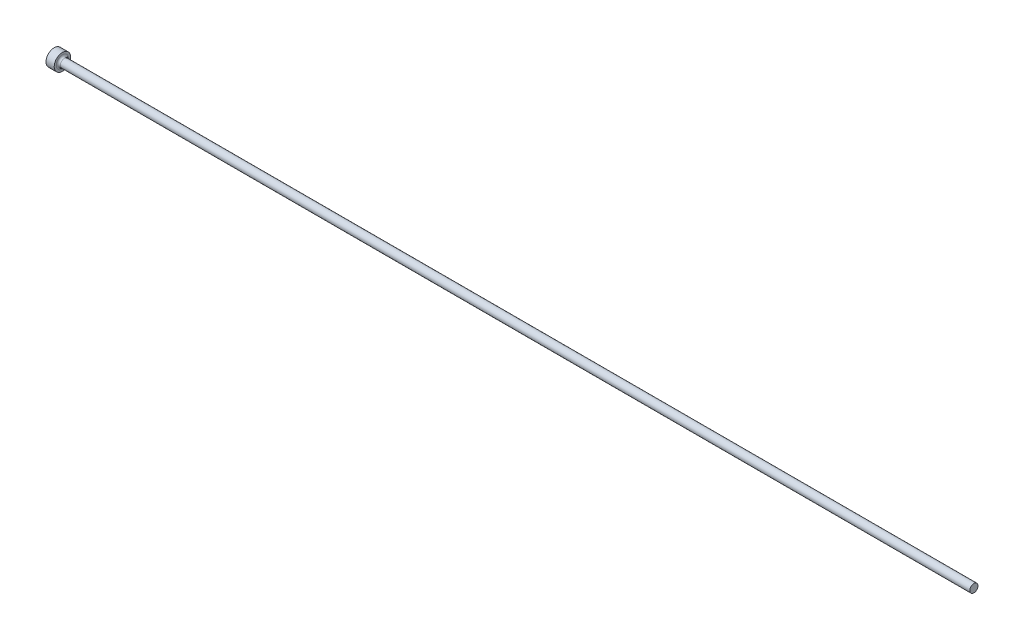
ISO-10303-21;
HEADER;
FILE_DESCRIPTION(('STEP AP214'),'2;1');
FILE_NAME('part.step','',(''),(''),'','','');
FILE_SCHEMA(('AUTOMOTIVE_DESIGN { 1 0 10303 214 1 1 1 1 }'));
ENDSEC;
DATA;
#1=APPLICATION_CONTEXT('core data for automotive mechanical design processes');
#2=APPLICATION_PROTOCOL_DEFINITION('international standard','automotive_design',2000,#1);
#3=PRODUCT_CONTEXT('',#1,'mechanical');
#4=PRODUCT('Part','Part','',(#3));
#5=PRODUCT_RELATED_PRODUCT_CATEGORY('part','',(#4));
#6=PRODUCT_DEFINITION_FORMATION('','',#4);
#7=PRODUCT_DEFINITION_CONTEXT('part definition',#1,'design');
#8=PRODUCT_DEFINITION('design','',#6,#7);
#9=PRODUCT_DEFINITION_SHAPE('','',#8);
#10=(LENGTH_UNIT() NAMED_UNIT(*) SI_UNIT(.MILLI.,.METRE.));
#11=(NAMED_UNIT(*) PLANE_ANGLE_UNIT() SI_UNIT($,.RADIAN.));
#12=(NAMED_UNIT(*) SI_UNIT($,.STERADIAN.) SOLID_ANGLE_UNIT());
#13=UNCERTAINTY_MEASURE_WITH_UNIT(LENGTH_MEASURE(1.E-05),#10,'distance_accuracy_value','');
#14=(GEOMETRIC_REPRESENTATION_CONTEXT(3) GLOBAL_UNCERTAINTY_ASSIGNED_CONTEXT((#13)) GLOBAL_UNIT_ASSIGNED_CONTEXT((#10,
#11,#12)) REPRESENTATION_CONTEXT('',''));
#15=CARTESIAN_POINT('',(0.,0.,0.));
#16=DIRECTION('',(0.,0.,1.));
#17=DIRECTION('',(1.,0.,0.));
#18=AXIS2_PLACEMENT_3D('',#15,#16,#17);
#19=CARTESIAN_POINT('',(0.,0.,0.));
#20=DIRECTION('',(1.,0.,0.));
#21=DIRECTION('',(0.,1.,0.));
#22=AXIS2_PLACEMENT_3D('',#19,#20,#21);
#23=PLANE('',#22);
#24=CARTESIAN_POINT('',(0.,0.,0.));
#25=DIRECTION('',(-1.,0.,0.));
#26=DIRECTION('',(0.,-1.,0.));
#27=AXIS2_PLACEMENT_3D('',#24,#25,#26);
#28=CIRCLE('',#27,3.17499999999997);
#29=CARTESIAN_POINT('',(0.,-3.17499999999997,0.));
#30=VERTEX_POINT('',#29);
#31=EDGE_CURVE('E10',#30,#30,#28,.T.);
#32=ORIENTED_EDGE('',*,*,#31,.T.);
#33=EDGE_LOOP('',(#32));
#34=FACE_BOUND('',#33,.T.);
#35=ADVANCED_FACE('F28',(#34),#23,.F.);
#36=CARTESIAN_POINT('',(355.6,0.,0.));
#37=DIRECTION('',(-1.,0.,0.));
#38=DIRECTION('',(0.,-1.,0.));
#39=AXIS2_PLACEMENT_3D('',#36,#37,#38);
#40=CYLINDRICAL_SURFACE('',#39,3.17499999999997);
#41=ORIENTED_EDGE('',*,*,#31,.F.);
#42=EDGE_LOOP('',(#41));
#43=FACE_BOUND('',#42,.T.);
#44=CARTESIAN_POINT('',(3.17499999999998,0.,0.));
#45=DIRECTION('',(-1.,0.,0.));
#46=DIRECTION('',(0.,-1.,0.));
#47=AXIS2_PLACEMENT_3D('',#44,#45,#46);
#48=CIRCLE('',#47,3.17499999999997);
#49=CARTESIAN_POINT('',(3.17499999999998,-3.17499999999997,0.));
#50=VERTEX_POINT('',#49);
#51=EDGE_CURVE('E34',#50,#50,#48,.T.);
#52=ORIENTED_EDGE('',*,*,#51,.T.);
#53=EDGE_LOOP('',(#52));
#54=FACE_BOUND('',#53,.T.);
#55=ADVANCED_FACE('F63',(#43,#54),#40,.T.);
#56=CARTESIAN_POINT('',(3.175,3.17499999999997,0.));
#57=DIRECTION('',(-1.,0.,0.));
#58=DIRECTION('',(0.,-1.,0.));
#59=AXIS2_PLACEMENT_3D('',#56,#57,#58);
#60=PLANE('',#59);
#61=ORIENTED_EDGE('',*,*,#51,.F.);
#62=EDGE_LOOP('',(#61));
#63=FACE_BOUND('',#62,.T.);
#64=CARTESIAN_POINT('',(3.17499999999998,0.,0.));
#65=DIRECTION('',(-1.,0.,0.));
#66=DIRECTION('',(0.,-1.,0.));
#67=AXIS2_PLACEMENT_3D('',#64,#65,#66);
#68=CIRCLE('',#67,2.3749);
#69=CARTESIAN_POINT('',(3.17499999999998,-2.3749,0.));
#70=VERTEX_POINT('',#69);
#71=EDGE_CURVE('E38',#70,#70,#68,.T.);
#72=ORIENTED_EDGE('',*,*,#71,.T.);
#73=EDGE_LOOP('',(#72));
#74=FACE_BOUND('',#73,.T.);
#75=ADVANCED_FACE('F67',(#63,#74),#60,.F.);
#76=CARTESIAN_POINT('',(3.9624,0.,0.));
#77=DIRECTION('',(-1.,0.,0.));
#78=DIRECTION('',(0.,-1.,0.));
#79=AXIS2_PLACEMENT_3D('',#76,#77,#78);
#80=TOROIDAL_SURFACE('',#79,2.3749,0.7874);
#81=ORIENTED_EDGE('',*,*,#71,.F.);
#82=EDGE_LOOP('',(#81));
#83=FACE_BOUND('',#82,.T.);
#84=CARTESIAN_POINT('',(3.96239999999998,0.,0.));
#85=DIRECTION('',(-1.,0.,0.));
#86=DIRECTION('',(0.,-1.,0.));
#87=AXIS2_PLACEMENT_3D('',#84,#85,#86);
#88=CIRCLE('',#87,1.5875);
#89=CARTESIAN_POINT('',(3.96239999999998,-1.5875,0.));
#90=VERTEX_POINT('',#89);
#91=EDGE_CURVE('E42',#90,#90,#88,.T.);
#92=ORIENTED_EDGE('',*,*,#91,.T.);
#93=EDGE_LOOP('',(#92));
#94=FACE_BOUND('',#93,.T.);
#95=ADVANCED_FACE('F59',(#83,#94),#80,.F.);
#96=CARTESIAN_POINT('',(355.6,0.,0.));
#97=DIRECTION('',(-1.,0.,0.));
#98=DIRECTION('',(0.,-1.,0.));
#99=AXIS2_PLACEMENT_3D('',#96,#97,#98);
#100=CYLINDRICAL_SURFACE('',#99,1.58749999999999);
#101=ORIENTED_EDGE('',*,*,#91,.F.);
#102=EDGE_LOOP('',(#101));
#103=FACE_BOUND('',#102,.T.);
#104=CARTESIAN_POINT('',(355.6,0.,0.));
#105=DIRECTION('',(-1.,0.,0.));
#106=DIRECTION('',(0.,-1.,0.));
#107=AXIS2_PLACEMENT_3D('',#104,#105,#106);
#108=CIRCLE('',#107,1.58749999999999);
#109=CARTESIAN_POINT('',(355.6,-1.58749999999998,0.));
#110=VERTEX_POINT('',#109);
#111=EDGE_CURVE('E47',#110,#110,#108,.T.);
#112=ORIENTED_EDGE('',*,*,#111,.T.);
#113=EDGE_LOOP('',(#112));
#114=FACE_BOUND('',#113,.T.);
#115=ADVANCED_FACE('F51',(#103,#114),#100,.T.);
#116=CARTESIAN_POINT('',(355.6,1.5875,0.));
#117=DIRECTION('',(-1.,0.,0.));
#118=DIRECTION('',(0.,-1.,0.));
#119=AXIS2_PLACEMENT_3D('',#116,#117,#118);
#120=PLANE('',#119);
#121=ORIENTED_EDGE('',*,*,#111,.F.);
#122=EDGE_LOOP('',(#121));
#123=FACE_BOUND('',#122,.T.);
#124=ADVANCED_FACE('F53',(#123),#120,.F.);
#125=CLOSED_SHELL('',(#35,#55,#75,#95,#115,#124));
#126=MANIFOLD_SOLID_BREP('B2',#125);
#127=ADVANCED_BREP_SHAPE_REPRESENTATION('',(#18,#126),#14);
#128=SHAPE_DEFINITION_REPRESENTATION(#9,#127);
ENDSEC;
END-ISO-10303-21;
